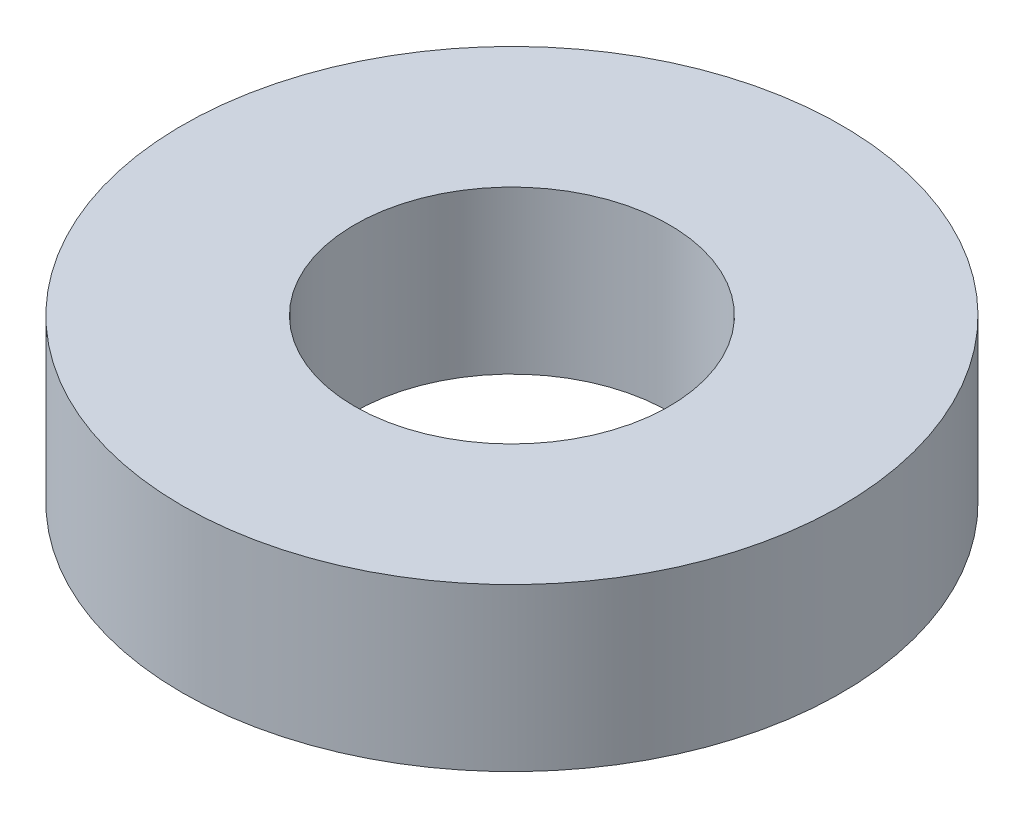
ISO-10303-21;
HEADER;
FILE_DESCRIPTION(('STEP AP214'),'2;1');
FILE_NAME('part.step','',(''),(''),'','','');
FILE_SCHEMA(('AUTOMOTIVE_DESIGN { 1 0 10303 214 1 1 1 1 }'));
ENDSEC;
DATA;
#1=APPLICATION_CONTEXT('core data for automotive mechanical design processes');
#2=APPLICATION_PROTOCOL_DEFINITION('international standard','automotive_design',2000,#1);
#3=PRODUCT_CONTEXT('',#1,'mechanical');
#4=PRODUCT('Part','Part','',(#3));
#5=PRODUCT_RELATED_PRODUCT_CATEGORY('part','',(#4));
#6=PRODUCT_DEFINITION_FORMATION('','',#4);
#7=PRODUCT_DEFINITION_CONTEXT('part definition',#1,'design');
#8=PRODUCT_DEFINITION('design','',#6,#7);
#9=PRODUCT_DEFINITION_SHAPE('','',#8);
#10=(LENGTH_UNIT() NAMED_UNIT(*) SI_UNIT(.MILLI.,.METRE.));
#11=(NAMED_UNIT(*) PLANE_ANGLE_UNIT() SI_UNIT($,.RADIAN.));
#12=(NAMED_UNIT(*) SI_UNIT($,.STERADIAN.) SOLID_ANGLE_UNIT());
#13=UNCERTAINTY_MEASURE_WITH_UNIT(LENGTH_MEASURE(1.E-05),#10,'distance_accuracy_value','');
#14=(GEOMETRIC_REPRESENTATION_CONTEXT(3) GLOBAL_UNCERTAINTY_ASSIGNED_CONTEXT((#13)) GLOBAL_UNIT_ASSIGNED_CONTEXT((#10,
#11,#12)) REPRESENTATION_CONTEXT('',''));
#15=CARTESIAN_POINT('',(0.,0.,0.));
#16=DIRECTION('',(0.,0.,1.));
#17=DIRECTION('',(1.,0.,0.));
#18=AXIS2_PLACEMENT_3D('',#15,#16,#17);
#19=CARTESIAN_POINT('',(0.,2.2098,0.));
#20=DIRECTION('',(0.,1.,0.));
#21=DIRECTION('',(0.,0.,1.));
#22=AXIS2_PLACEMENT_3D('',#19,#20,#21);
#23=PLANE('',#22);
#24=CARTESIAN_POINT('',(0.,2.2098,0.));
#25=DIRECTION('',(0.,1.,0.));
#26=DIRECTION('',(0.,0.,1.));
#27=AXIS2_PLACEMENT_3D('',#24,#25,#26);
#28=CIRCLE('',#27,4.4958);
#29=CARTESIAN_POINT('',(0.,2.2098,4.4958));
#30=VERTEX_POINT('',#29);
#31=EDGE_CURVE('E10',#30,#30,#28,.T.);
#32=ORIENTED_EDGE('',*,*,#31,.T.);
#33=EDGE_LOOP('',(#32));
#34=FACE_BOUND('',#33,.T.);
#35=CARTESIAN_POINT('',(0.,2.2098,0.));
#36=DIRECTION('',(0.,1.,0.));
#37=DIRECTION('',(0.,0.,1.));
#38=AXIS2_PLACEMENT_3D('',#35,#36,#37);
#39=CIRCLE('',#38,2.1463);
#40=CARTESIAN_POINT('',(0.,2.2098,2.1463));
#41=VERTEX_POINT('',#40);
#42=EDGE_CURVE('E41',#41,#41,#39,.T.);
#43=ORIENTED_EDGE('',*,*,#42,.F.);
#44=EDGE_LOOP('',(#43));
#45=FACE_BOUND('',#44,.T.);
#46=ADVANCED_FACE('F30',(#34,#45),#23,.T.);
#47=CARTESIAN_POINT('',(0.,0.,0.));
#48=DIRECTION('',(0.,1.,0.));
#49=DIRECTION('',(0.,0.,1.));
#50=AXIS2_PLACEMENT_3D('',#47,#48,#49);
#51=PLANE('',#50);
#52=CARTESIAN_POINT('',(0.,0.,0.));
#53=DIRECTION('',(0.,1.,0.));
#54=DIRECTION('',(0.,0.,1.));
#55=AXIS2_PLACEMENT_3D('',#52,#53,#54);
#56=CIRCLE('',#55,4.4958);
#57=CARTESIAN_POINT('',(0.,0.,4.4958));
#58=VERTEX_POINT('',#57);
#59=EDGE_CURVE('E37',#58,#58,#56,.T.);
#60=ORIENTED_EDGE('',*,*,#59,.F.);
#61=EDGE_LOOP('',(#60));
#62=FACE_BOUND('',#61,.T.);
#63=CARTESIAN_POINT('',(0.,0.,0.));
#64=DIRECTION('',(0.,1.,0.));
#65=DIRECTION('',(0.,0.,1.));
#66=AXIS2_PLACEMENT_3D('',#63,#64,#65);
#67=CIRCLE('',#66,2.1463);
#68=CARTESIAN_POINT('',(0.,0.,2.1463));
#69=VERTEX_POINT('',#68);
#70=EDGE_CURVE('E45',#69,#69,#67,.T.);
#71=ORIENTED_EDGE('',*,*,#70,.T.);
#72=EDGE_LOOP('',(#71));
#73=FACE_BOUND('',#72,.T.);
#74=ADVANCED_FACE('F51',(#62,#73),#51,.F.);
#75=CARTESIAN_POINT('',(0.,2.2098,0.));
#76=DIRECTION('',(0.,-1.,0.));
#77=DIRECTION('',(0.,0.,-1.));
#78=AXIS2_PLACEMENT_3D('',#75,#76,#77);
#79=CYLINDRICAL_SURFACE('',#78,4.4958);
#80=ORIENTED_EDGE('',*,*,#31,.F.);
#81=EDGE_LOOP('',(#80));
#82=FACE_BOUND('',#81,.T.);
#83=ORIENTED_EDGE('',*,*,#59,.T.);
#84=EDGE_LOOP('',(#83));
#85=FACE_BOUND('',#84,.T.);
#86=ADVANCED_FACE('F32',(#82,#85),#79,.T.);
#87=CARTESIAN_POINT('',(0.,2.2098,0.));
#88=DIRECTION('',(0.,-1.,0.));
#89=DIRECTION('',(0.,0.,-1.));
#90=AXIS2_PLACEMENT_3D('',#87,#88,#89);
#91=CYLINDRICAL_SURFACE('',#90,2.1463);
#92=ORIENTED_EDGE('',*,*,#42,.T.);
#93=EDGE_LOOP('',(#92));
#94=FACE_BOUND('',#93,.T.);
#95=ORIENTED_EDGE('',*,*,#70,.F.);
#96=EDGE_LOOP('',(#95));
#97=FACE_BOUND('',#96,.T.);
#98=ADVANCED_FACE('F53',(#94,#97),#91,.F.);
#99=CLOSED_SHELL('',(#46,#74,#86,#98));
#100=MANIFOLD_SOLID_BREP('B2',#99);
#101=ADVANCED_BREP_SHAPE_REPRESENTATION('',(#18,#100),#14);
#102=SHAPE_DEFINITION_REPRESENTATION(#9,#101);
ENDSEC;
END-ISO-10303-21;
